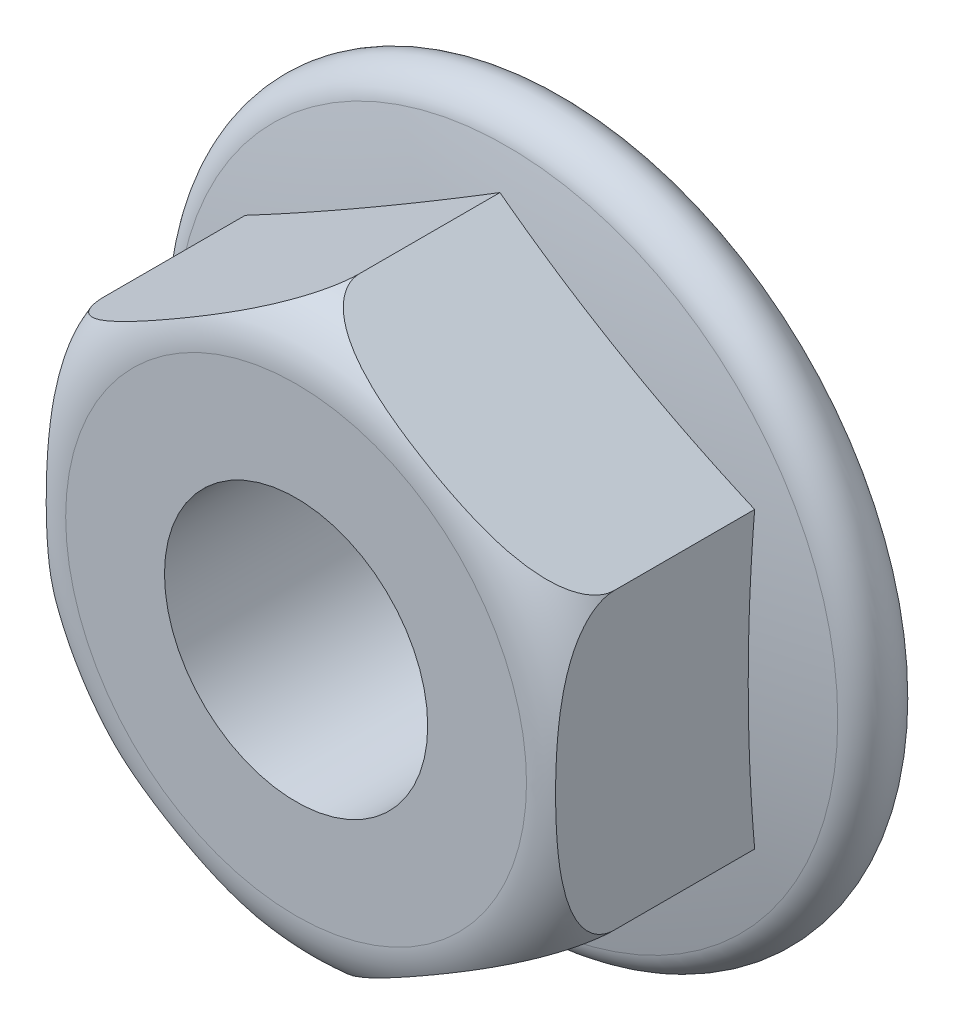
from build123d import *

# Parameters (mm, degrees)
HEAD_DEPTH         = 4.3
HOLE_SKETCH_R      = 2.067
THROUGH_HOLE_DEPTH = 10.011659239


with BuildPart() as part:
    # Head Sketch → Head (new body)
    with BuildSketch(Plane.XY):
        Polygon((0, 4.618802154), (4, 2.309401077), (4, -2.309401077), (0, -4.618802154), (-4, -2.309401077), (-4, 2.309401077), align=None)
    extrude(amount=HEAD_DEPTH)

    # Flange Sketch → Flange (revolve)
    with BuildSketch(Plane(origin=(0, 0, 0), x_dir=(-1, 0, 0), z_dir=(0, 1, 0)), mode=Mode.PRIVATE) as flange_sk:
        with BuildLine():
            Line((-5.1, 0), (0, 0))
            Line((0, 0), (0, 1.5))
            ThreePointArc((0, 1.5), (-2.611011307, 1.372315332), (-5.197105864, 0.990479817))
            ThreePointArc((-5.197105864, 0.990479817), (-5.597614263, 0.451214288), (-5.1, 0))
        make_face()
    revolve(flange_sk.sketch.rotate(Axis((0, 0, 1.843425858), (0, 0, -1)), 150), axis=Axis((0, 0, 1.843425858), (0, 0, -1)))

    # Sketch5 → Head Trim (revolve, cut)
    with BuildSketch(Plane(origin=(0, 0, 0), x_dir=(0, 0, -1), z_dir=(1, 0, 0)), mode=Mode.PRIVATE) as head_trim_sk:
        with BuildLine():
            Line((-4.3, -3.618802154), (-4.3, -4.618802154))
            Line((-4.3, -4.618802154), (-3.3, -4.618802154))
            ThreePointArc((-3.3, -4.618802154), (-4.007106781, -4.325908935), (-4.3, -3.618802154))
        make_face()
    revolve(head_trim_sk.sketch.rotate(Axis((0, 0, 15.085599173), (0, 0, -1)), 270), axis=Axis((0, 0, 15.085599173), (0, 0, -1)), mode=Mode.SUBTRACT)

    # Hole Sketch → Through Hole (cut, through all)
    with BuildSketch(Plane.XY.offset(4.3)):
        Circle(HOLE_SKETCH_R)
    extrude(amount=-THROUGH_HOLE_DEPTH, mode=Mode.SUBTRACT)


solid = part.part
